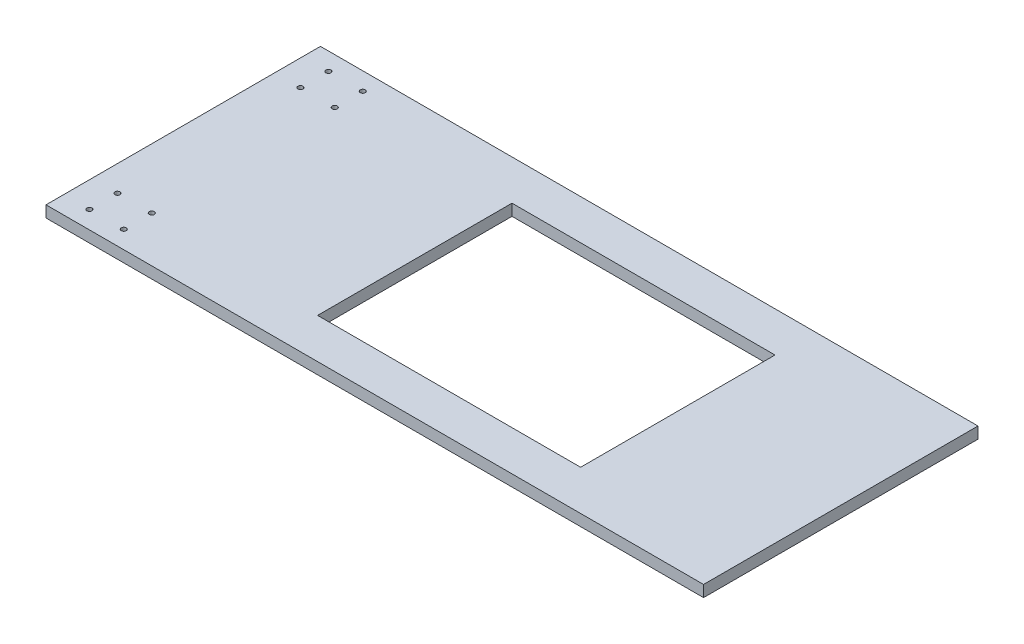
ISO-10303-21;
HEADER;
FILE_DESCRIPTION(('STEP AP214'),'2;1');
FILE_NAME('part.step','',(''),(''),'','','');
FILE_SCHEMA(('AUTOMOTIVE_DESIGN { 1 0 10303 214 1 1 1 1 }'));
ENDSEC;
DATA;
#1=APPLICATION_CONTEXT('core data for automotive mechanical design processes');
#2=APPLICATION_PROTOCOL_DEFINITION('international standard','automotive_design',2000,#1);
#3=PRODUCT_CONTEXT('',#1,'mechanical');
#4=PRODUCT('Part','Part','',(#3));
#5=PRODUCT_RELATED_PRODUCT_CATEGORY('part','',(#4));
#6=PRODUCT_DEFINITION_FORMATION('','',#4);
#7=PRODUCT_DEFINITION_CONTEXT('part definition',#1,'design');
#8=PRODUCT_DEFINITION('design','',#6,#7);
#9=PRODUCT_DEFINITION_SHAPE('','',#8);
#10=(LENGTH_UNIT() NAMED_UNIT(*) SI_UNIT(.MILLI.,.METRE.));
#11=(NAMED_UNIT(*) PLANE_ANGLE_UNIT() SI_UNIT($,.RADIAN.));
#12=(NAMED_UNIT(*) SI_UNIT($,.STERADIAN.) SOLID_ANGLE_UNIT());
#13=UNCERTAINTY_MEASURE_WITH_UNIT(LENGTH_MEASURE(1.E-05),#10,'distance_accuracy_value','');
#14=(GEOMETRIC_REPRESENTATION_CONTEXT(3) GLOBAL_UNCERTAINTY_ASSIGNED_CONTEXT((#13)) GLOBAL_UNIT_ASSIGNED_CONTEXT((#10,
#11,#12)) REPRESENTATION_CONTEXT('',''));
#15=CARTESIAN_POINT('',(0.,0.,0.));
#16=DIRECTION('',(0.,0.,1.));
#17=DIRECTION('',(1.,0.,0.));
#18=AXIS2_PLACEMENT_3D('',#15,#16,#17);
#19=CARTESIAN_POINT('',(-287.5,31.5,-120.));
#20=DIRECTION('',(1.,0.,0.));
#21=DIRECTION('',(0.,0.,-1.));
#22=AXIS2_PLACEMENT_3D('',#19,#20,#21);
#23=PLANE('',#22);
#24=DIRECTION('',(0.,0.,1.));
#25=VECTOR('',#24,1.);
#26=CARTESIAN_POINT('',(-287.5,0.,-120.));
#27=LINE('',#26,#25);
#28=CARTESIAN_POINT('',(-287.5,0.,-120.));
#29=VERTEX_POINT('',#28);
#30=CARTESIAN_POINT('',(-287.5,0.,120.));
#31=VERTEX_POINT('',#30);
#32=EDGE_CURVE('E139',#29,#31,#27,.T.);
#33=ORIENTED_EDGE('',*,*,#32,.T.);
#34=DIRECTION('',(0.,-1.,0.));
#35=VECTOR('',#34,1.);
#36=CARTESIAN_POINT('',(-287.5,31.5,120.));
#37=LINE('',#36,#35);
#38=CARTESIAN_POINT('',(-287.5,10.,120.));
#39=VERTEX_POINT('',#38);
#40=EDGE_CURVE('E12',#39,#31,#37,.T.);
#41=ORIENTED_EDGE('',*,*,#40,.F.);
#42=DIRECTION('',(0.,0.,-1.));
#43=VECTOR('',#42,1.);
#44=CARTESIAN_POINT('',(-287.5,10.,-120.));
#45=LINE('',#44,#43);
#46=CARTESIAN_POINT('',(-287.5,10.,-120.));
#47=VERTEX_POINT('',#46);
#48=EDGE_CURVE('E101',#39,#47,#45,.T.);
#49=ORIENTED_EDGE('',*,*,#48,.T.);
#50=DIRECTION('',(0.,-1.,0.));
#51=VECTOR('',#50,1.);
#52=CARTESIAN_POINT('',(-287.5,31.5,-120.));
#53=LINE('',#52,#51);
#54=EDGE_CURVE('E104',#47,#29,#53,.T.);
#55=ORIENTED_EDGE('',*,*,#54,.T.);
#56=EDGE_LOOP('',(#33,#41,#49,#55));
#57=FACE_BOUND('',#56,.T.);
#58=ADVANCED_FACE('F37',(#57),#23,.F.);
#59=CARTESIAN_POINT('',(287.5,31.5,120.));
#60=DIRECTION('',(0.,0.,-1.));
#61=DIRECTION('',(-1.,0.,0.));
#62=AXIS2_PLACEMENT_3D('',#59,#60,#61);
#63=PLANE('',#62);
#64=DIRECTION('',(0.,-1.,0.));
#65=VECTOR('',#64,1.);
#66=CARTESIAN_POINT('',(287.5,31.5,120.));
#67=LINE('',#66,#65);
#68=CARTESIAN_POINT('',(287.5,10.,120.));
#69=VERTEX_POINT('',#68);
#70=CARTESIAN_POINT('',(287.5,0.,120.));
#71=VERTEX_POINT('',#70);
#72=EDGE_CURVE('E44',#69,#71,#67,.T.);
#73=ORIENTED_EDGE('',*,*,#72,.F.);
#74=DIRECTION('',(-1.,0.,0.));
#75=VECTOR('',#74,1.);
#76=CARTESIAN_POINT('',(287.5,10.,120.));
#77=LINE('',#76,#75);
#78=EDGE_CURVE('E199',#69,#39,#77,.T.);
#79=ORIENTED_EDGE('',*,*,#78,.T.);
#80=ORIENTED_EDGE('',*,*,#40,.T.);
#81=DIRECTION('',(1.,0.,0.));
#82=VECTOR('',#81,1.);
#83=CARTESIAN_POINT('',(287.5,0.,120.));
#84=LINE('',#83,#82);
#85=EDGE_CURVE('E136',#31,#71,#84,.T.);
#86=ORIENTED_EDGE('',*,*,#85,.T.);
#87=EDGE_LOOP('',(#73,#79,#80,#86));
#88=FACE_BOUND('',#87,.T.);
#89=ADVANCED_FACE('F137',(#88),#63,.F.);
#90=CARTESIAN_POINT('',(287.5,31.5,-120.));
#91=DIRECTION('',(-1.,0.,0.));
#92=DIRECTION('',(0.,0.,1.));
#93=AXIS2_PLACEMENT_3D('',#90,#91,#92);
#94=PLANE('',#93);
#95=DIRECTION('',(0.,-1.,0.));
#96=VECTOR('',#95,1.);
#97=CARTESIAN_POINT('',(287.5,31.5,-120.));
#98=LINE('',#97,#96);
#99=CARTESIAN_POINT('',(287.5,10.,-120.));
#100=VERTEX_POINT('',#99);
#101=CARTESIAN_POINT('',(287.5,0.,-120.));
#102=VERTEX_POINT('',#101);
#103=EDGE_CURVE('E122',#100,#102,#98,.T.);
#104=ORIENTED_EDGE('',*,*,#103,.F.);
#105=DIRECTION('',(0.,0.,1.));
#106=VECTOR('',#105,1.);
#107=CARTESIAN_POINT('',(287.5,10.,-120.));
#108=LINE('',#107,#106);
#109=EDGE_CURVE('E114',#100,#69,#108,.T.);
#110=ORIENTED_EDGE('',*,*,#109,.T.);
#111=ORIENTED_EDGE('',*,*,#72,.T.);
#112=DIRECTION('',(0.,0.,-1.));
#113=VECTOR('',#112,1.);
#114=CARTESIAN_POINT('',(287.5,0.,-120.));
#115=LINE('',#114,#113);
#116=EDGE_CURVE('E125',#71,#102,#115,.T.);
#117=ORIENTED_EDGE('',*,*,#116,.T.);
#118=EDGE_LOOP('',(#104,#110,#111,#117));
#119=FACE_BOUND('',#118,.T.);
#120=ADVANCED_FACE('F132',(#119),#94,.F.);
#121=CARTESIAN_POINT('',(287.5,31.5,-120.));
#122=DIRECTION('',(0.,0.,1.));
#123=DIRECTION('',(1.,0.,0.));
#124=AXIS2_PLACEMENT_3D('',#121,#122,#123);
#125=PLANE('',#124);
#126=ORIENTED_EDGE('',*,*,#54,.F.);
#127=DIRECTION('',(1.,0.,0.));
#128=VECTOR('',#127,1.);
#129=CARTESIAN_POINT('',(287.5,10.,-120.));
#130=LINE('',#129,#128);
#131=EDGE_CURVE('E108',#47,#100,#130,.T.);
#132=ORIENTED_EDGE('',*,*,#131,.T.);
#133=ORIENTED_EDGE('',*,*,#103,.T.);
#134=DIRECTION('',(-1.,0.,0.));
#135=VECTOR('',#134,1.);
#136=CARTESIAN_POINT('',(287.5,0.,-120.));
#137=LINE('',#136,#135);
#138=EDGE_CURVE('E120',#102,#29,#137,.T.);
#139=ORIENTED_EDGE('',*,*,#138,.T.);
#140=EDGE_LOOP('',(#126,#132,#133,#139));
#141=FACE_BOUND('',#140,.T.);
#142=ADVANCED_FACE('F118',(#141),#125,.F.);
#143=CARTESIAN_POINT('',(0.,0.,0.));
#144=DIRECTION('',(0.,-1.,0.));
#145=DIRECTION('',(0.,0.,-1.));
#146=AXIS2_PLACEMENT_3D('',#143,#144,#145);
#147=PLANE('',#146);
#148=ORIENTED_EDGE('',*,*,#85,.F.);
#149=ORIENTED_EDGE('',*,*,#32,.F.);
#150=ORIENTED_EDGE('',*,*,#138,.F.);
#151=ORIENTED_EDGE('',*,*,#116,.F.);
#152=EDGE_LOOP('',(#148,#149,#150,#151));
#153=FACE_BOUND('',#152,.T.);
#154=CARTESIAN_POINT('',(-235.,0.,-80.));
#155=DIRECTION('',(0.,-1.,0.));
#156=DIRECTION('',(0.,0.,-1.));
#157=AXIS2_PLACEMENT_3D('',#154,#155,#156);
#158=CIRCLE('',#157,2.19999999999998);
#159=CARTESIAN_POINT('',(-235.,0.,-82.2));
#160=VERTEX_POINT('',#159);
#161=EDGE_CURVE('E178',#160,#160,#158,.F.);
#162=ORIENTED_EDGE('',*,*,#161,.T.);
#163=EDGE_LOOP('',(#162));
#164=FACE_BOUND('',#163,.T.);
#165=CARTESIAN_POINT('',(-235.,0.,-104.5));
#166=DIRECTION('',(0.,-1.,0.));
#167=DIRECTION('',(0.,0.,-1.));
#168=AXIS2_PLACEMENT_3D('',#165,#166,#167);
#169=CIRCLE('',#168,2.19999999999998);
#170=CARTESIAN_POINT('',(-235.,0.,-106.7));
#171=VERTEX_POINT('',#170);
#172=EDGE_CURVE('E181',#171,#171,#169,.F.);
#173=ORIENTED_EDGE('',*,*,#172,.T.);
#174=EDGE_LOOP('',(#173));
#175=FACE_BOUND('',#174,.T.);
#176=CARTESIAN_POINT('',(-265.,0.,-104.5));
#177=DIRECTION('',(0.,-1.,0.));
#178=DIRECTION('',(0.,0.,-1.));
#179=AXIS2_PLACEMENT_3D('',#176,#177,#178);
#180=CIRCLE('',#179,2.19999999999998);
#181=CARTESIAN_POINT('',(-265.,0.,-106.7));
#182=VERTEX_POINT('',#181);
#183=EDGE_CURVE('E184',#182,#182,#180,.F.);
#184=ORIENTED_EDGE('',*,*,#183,.T.);
#185=EDGE_LOOP('',(#184));
#186=FACE_BOUND('',#185,.T.);
#187=CARTESIAN_POINT('',(-265.,0.,-80.));
#188=DIRECTION('',(0.,-1.,0.));
#189=DIRECTION('',(0.,0.,-1.));
#190=AXIS2_PLACEMENT_3D('',#187,#188,#189);
#191=CIRCLE('',#190,2.19999999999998);
#192=CARTESIAN_POINT('',(-265.,0.,-82.2));
#193=VERTEX_POINT('',#192);
#194=EDGE_CURVE('E187',#193,#193,#191,.F.);
#195=ORIENTED_EDGE('',*,*,#194,.T.);
#196=EDGE_LOOP('',(#195));
#197=FACE_BOUND('',#196,.T.);
#198=CARTESIAN_POINT('',(-235.,0.,80.));
#199=DIRECTION('',(0.,-1.,0.));
#200=DIRECTION('',(0.,0.,-1.));
#201=AXIS2_PLACEMENT_3D('',#198,#199,#200);
#202=CIRCLE('',#201,2.19999999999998);
#203=CARTESIAN_POINT('',(-235.,0.,77.8));
#204=VERTEX_POINT('',#203);
#205=EDGE_CURVE('E166',#204,#204,#202,.T.);
#206=ORIENTED_EDGE('',*,*,#205,.F.);
#207=EDGE_LOOP('',(#206));
#208=FACE_BOUND('',#207,.T.);
#209=CARTESIAN_POINT('',(-235.,0.,104.5));
#210=DIRECTION('',(0.,-1.,0.));
#211=DIRECTION('',(0.,0.,-1.));
#212=AXIS2_PLACEMENT_3D('',#209,#210,#211);
#213=CIRCLE('',#212,2.19999999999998);
#214=CARTESIAN_POINT('',(-235.,0.,102.3));
#215=VERTEX_POINT('',#214);
#216=EDGE_CURVE('E169',#215,#215,#213,.T.);
#217=ORIENTED_EDGE('',*,*,#216,.F.);
#218=EDGE_LOOP('',(#217));
#219=FACE_BOUND('',#218,.T.);
#220=CARTESIAN_POINT('',(-265.,0.,104.5));
#221=DIRECTION('',(0.,-1.,0.));
#222=DIRECTION('',(0.,0.,-1.));
#223=AXIS2_PLACEMENT_3D('',#220,#221,#222);
#224=CIRCLE('',#223,2.19999999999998);
#225=CARTESIAN_POINT('',(-265.,0.,102.3));
#226=VERTEX_POINT('',#225);
#227=EDGE_CURVE('E172',#226,#226,#224,.T.);
#228=ORIENTED_EDGE('',*,*,#227,.F.);
#229=EDGE_LOOP('',(#228));
#230=FACE_BOUND('',#229,.T.);
#231=CARTESIAN_POINT('',(-265.,0.,80.));
#232=DIRECTION('',(0.,-1.,0.));
#233=DIRECTION('',(0.,0.,-1.));
#234=AXIS2_PLACEMENT_3D('',#231,#232,#233);
#235=CIRCLE('',#234,2.19999999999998);
#236=CARTESIAN_POINT('',(-265.,0.,77.8));
#237=VERTEX_POINT('',#236);
#238=EDGE_CURVE('E175',#237,#237,#235,.T.);
#239=ORIENTED_EDGE('',*,*,#238,.F.);
#240=EDGE_LOOP('',(#239));
#241=FACE_BOUND('',#240,.T.);
#242=DIRECTION('',(0.,0.,1.));
#243=VECTOR('',#242,1.);
#244=CARTESIAN_POINT('',(-85.,0.,-85.));
#245=LINE('',#244,#243);
#246=CARTESIAN_POINT('',(-85.,0.,-85.));
#247=VERTEX_POINT('',#246);
#248=CARTESIAN_POINT('',(-85.,0.,85.));
#249=VERTEX_POINT('',#248);
#250=EDGE_CURVE('E163',#247,#249,#245,.T.);
#251=ORIENTED_EDGE('',*,*,#250,.T.);
#252=DIRECTION('',(1.,0.,0.));
#253=VECTOR('',#252,1.);
#254=CARTESIAN_POINT('',(145.,0.,85.));
#255=LINE('',#254,#253);
#256=CARTESIAN_POINT('',(145.,0.,85.));
#257=VERTEX_POINT('',#256);
#258=EDGE_CURVE('E160',#249,#257,#255,.T.);
#259=ORIENTED_EDGE('',*,*,#258,.T.);
#260=DIRECTION('',(0.,0.,-1.));
#261=VECTOR('',#260,1.);
#262=CARTESIAN_POINT('',(145.,0.,-85.));
#263=LINE('',#262,#261);
#264=CARTESIAN_POINT('',(145.,0.,-85.));
#265=VERTEX_POINT('',#264);
#266=EDGE_CURVE('E59',#257,#265,#263,.T.);
#267=ORIENTED_EDGE('',*,*,#266,.T.);
#268=DIRECTION('',(-1.,0.,0.));
#269=VECTOR('',#268,1.);
#270=CARTESIAN_POINT('',(145.,0.,-85.));
#271=LINE('',#270,#269);
#272=EDGE_CURVE('E150',#265,#247,#271,.T.);
#273=ORIENTED_EDGE('',*,*,#272,.T.);
#274=EDGE_LOOP('',(#251,#259,#267,#273));
#275=FACE_BOUND('',#274,.T.);
#276=ADVANCED_FACE('F141',(#153,#164,#175,#186,#197,#208,#219,#230,#241,#275),#147,.T.);
#277=CARTESIAN_POINT('',(-85.,0.,-85.));
#278=DIRECTION('',(-1.,0.,0.));
#279=DIRECTION('',(0.,0.,1.));
#280=AXIS2_PLACEMENT_3D('',#277,#278,#279);
#281=PLANE('',#280);
#282=DIRECTION('',(0.,1.,0.));
#283=VECTOR('',#282,1.);
#284=CARTESIAN_POINT('',(-85.,0.,-85.));
#285=LINE('',#284,#283);
#286=CARTESIAN_POINT('',(-85.,10.,-85.));
#287=VERTEX_POINT('',#286);
#288=EDGE_CURVE('E145',#247,#287,#285,.T.);
#289=ORIENTED_EDGE('',*,*,#288,.T.);
#290=DIRECTION('',(0.,0.,1.));
#291=VECTOR('',#290,1.);
#292=CARTESIAN_POINT('',(-85.,10.,-85.));
#293=LINE('',#292,#291);
#294=CARTESIAN_POINT('',(-85.,10.,85.));
#295=VERTEX_POINT('',#294);
#296=EDGE_CURVE('E190',#287,#295,#293,.T.);
#297=ORIENTED_EDGE('',*,*,#296,.T.);
#298=DIRECTION('',(0.,1.,0.));
#299=VECTOR('',#298,1.);
#300=CARTESIAN_POINT('',(-85.,0.,85.));
#301=LINE('',#300,#299);
#302=EDGE_CURVE('E146',#249,#295,#301,.T.);
#303=ORIENTED_EDGE('',*,*,#302,.F.);
#304=ORIENTED_EDGE('',*,*,#250,.F.);
#305=EDGE_LOOP('',(#289,#297,#303,#304));
#306=FACE_BOUND('',#305,.T.);
#307=ADVANCED_FACE('F256',(#306),#281,.F.);
#308=CARTESIAN_POINT('',(145.,0.,-85.));
#309=DIRECTION('',(0.,0.,-1.));
#310=DIRECTION('',(-1.,0.,0.));
#311=AXIS2_PLACEMENT_3D('',#308,#309,#310);
#312=PLANE('',#311);
#313=DIRECTION('',(0.,1.,0.));
#314=VECTOR('',#313,1.);
#315=CARTESIAN_POINT('',(145.,0.,-85.));
#316=LINE('',#315,#314);
#317=CARTESIAN_POINT('',(145.,10.,-85.));
#318=VERTEX_POINT('',#317);
#319=EDGE_CURVE('E152',#265,#318,#316,.T.);
#320=ORIENTED_EDGE('',*,*,#319,.T.);
#321=DIRECTION('',(-1.,0.,0.));
#322=VECTOR('',#321,1.);
#323=CARTESIAN_POINT('',(145.,10.,-85.));
#324=LINE('',#323,#322);
#325=EDGE_CURVE('E193',#318,#287,#324,.T.);
#326=ORIENTED_EDGE('',*,*,#325,.T.);
#327=ORIENTED_EDGE('',*,*,#288,.F.);
#328=ORIENTED_EDGE('',*,*,#272,.F.);
#329=EDGE_LOOP('',(#320,#326,#327,#328));
#330=FACE_BOUND('',#329,.T.);
#331=ADVANCED_FACE('F259',(#330),#312,.F.);
#332=CARTESIAN_POINT('',(145.,0.,-85.));
#333=DIRECTION('',(1.,0.,0.));
#334=DIRECTION('',(0.,0.,-1.));
#335=AXIS2_PLACEMENT_3D('',#332,#333,#334);
#336=PLANE('',#335);
#337=DIRECTION('',(0.,1.,0.));
#338=VECTOR('',#337,1.);
#339=CARTESIAN_POINT('',(145.,0.,85.));
#340=LINE('',#339,#338);
#341=CARTESIAN_POINT('',(145.,10.,85.));
#342=VERTEX_POINT('',#341);
#343=EDGE_CURVE('E149',#257,#342,#340,.T.);
#344=ORIENTED_EDGE('',*,*,#343,.T.);
#345=DIRECTION('',(0.,0.,-1.));
#346=VECTOR('',#345,1.);
#347=CARTESIAN_POINT('',(145.,10.,-85.));
#348=LINE('',#347,#346);
#349=EDGE_CURVE('E51',#342,#318,#348,.T.);
#350=ORIENTED_EDGE('',*,*,#349,.T.);
#351=ORIENTED_EDGE('',*,*,#319,.F.);
#352=ORIENTED_EDGE('',*,*,#266,.F.);
#353=EDGE_LOOP('',(#344,#350,#351,#352));
#354=FACE_BOUND('',#353,.T.);
#355=ADVANCED_FACE('F264',(#354),#336,.F.);
#356=CARTESIAN_POINT('',(145.,0.,85.));
#357=DIRECTION('',(0.,0.,1.));
#358=DIRECTION('',(1.,0.,0.));
#359=AXIS2_PLACEMENT_3D('',#356,#357,#358);
#360=PLANE('',#359);
#361=ORIENTED_EDGE('',*,*,#302,.T.);
#362=DIRECTION('',(1.,0.,0.));
#363=VECTOR('',#362,1.);
#364=CARTESIAN_POINT('',(145.,10.,85.));
#365=LINE('',#364,#363);
#366=EDGE_CURVE('E197',#295,#342,#365,.T.);
#367=ORIENTED_EDGE('',*,*,#366,.T.);
#368=ORIENTED_EDGE('',*,*,#343,.F.);
#369=ORIENTED_EDGE('',*,*,#258,.F.);
#370=EDGE_LOOP('',(#361,#367,#368,#369));
#371=FACE_BOUND('',#370,.T.);
#372=ADVANCED_FACE('F261',(#371),#360,.F.);
#373=CARTESIAN_POINT('',(-265.,-3.,80.));
#374=DIRECTION('',(0.,1.,0.));
#375=DIRECTION('',(0.,0.,1.));
#376=AXIS2_PLACEMENT_3D('',#373,#374,#375);
#377=CYLINDRICAL_SURFACE('',#376,2.19999999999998);
#378=ORIENTED_EDGE('',*,*,#238,.T.);
#379=EDGE_LOOP('',(#378));
#380=FACE_BOUND('',#379,.T.);
#381=CARTESIAN_POINT('',(-265.,10.,80.));
#382=DIRECTION('',(0.,-1.,0.));
#383=DIRECTION('',(0.,0.,-1.));
#384=AXIS2_PLACEMENT_3D('',#381,#382,#383);
#385=CIRCLE('',#384,2.19999999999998);
#386=CARTESIAN_POINT('',(-265.,10.,77.8));
#387=VERTEX_POINT('',#386);
#388=EDGE_CURVE('E217',#387,#387,#385,.T.);
#389=ORIENTED_EDGE('',*,*,#388,.F.);
#390=EDGE_LOOP('',(#389));
#391=FACE_BOUND('',#390,.T.);
#392=ADVANCED_FACE('F240',(#380,#391),#377,.F.);
#393=CARTESIAN_POINT('',(-265.,-3.,104.5));
#394=DIRECTION('',(0.,1.,0.));
#395=DIRECTION('',(0.,0.,1.));
#396=AXIS2_PLACEMENT_3D('',#393,#394,#395);
#397=CYLINDRICAL_SURFACE('',#396,2.19999999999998);
#398=ORIENTED_EDGE('',*,*,#227,.T.);
#399=EDGE_LOOP('',(#398));
#400=FACE_BOUND('',#399,.T.);
#401=CARTESIAN_POINT('',(-265.,10.,104.5));
#402=DIRECTION('',(0.,-1.,0.));
#403=DIRECTION('',(0.,0.,-1.));
#404=AXIS2_PLACEMENT_3D('',#401,#402,#403);
#405=CIRCLE('',#404,2.19999999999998);
#406=CARTESIAN_POINT('',(-265.,10.,102.3));
#407=VERTEX_POINT('',#406);
#408=EDGE_CURVE('E220',#407,#407,#405,.T.);
#409=ORIENTED_EDGE('',*,*,#408,.F.);
#410=EDGE_LOOP('',(#409));
#411=FACE_BOUND('',#410,.T.);
#412=ADVANCED_FACE('F230',(#400,#411),#397,.F.);
#413=CARTESIAN_POINT('',(-235.,-3.,104.5));
#414=DIRECTION('',(0.,1.,0.));
#415=DIRECTION('',(0.,0.,1.));
#416=AXIS2_PLACEMENT_3D('',#413,#414,#415);
#417=CYLINDRICAL_SURFACE('',#416,2.19999999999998);
#418=ORIENTED_EDGE('',*,*,#216,.T.);
#419=EDGE_LOOP('',(#418));
#420=FACE_BOUND('',#419,.T.);
#421=CARTESIAN_POINT('',(-235.,10.,104.5));
#422=DIRECTION('',(0.,-1.,0.));
#423=DIRECTION('',(0.,0.,-1.));
#424=AXIS2_PLACEMENT_3D('',#421,#422,#423);
#425=CIRCLE('',#424,2.19999999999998);
#426=CARTESIAN_POINT('',(-235.,10.,102.3));
#427=VERTEX_POINT('',#426);
#428=EDGE_CURVE('E109',#427,#427,#425,.T.);
#429=ORIENTED_EDGE('',*,*,#428,.F.);
#430=EDGE_LOOP('',(#429));
#431=FACE_BOUND('',#430,.T.);
#432=ADVANCED_FACE('F227',(#420,#431),#417,.F.);
#433=CARTESIAN_POINT('',(-235.,-3.,80.));
#434=DIRECTION('',(0.,1.,0.));
#435=DIRECTION('',(0.,0.,1.));
#436=AXIS2_PLACEMENT_3D('',#433,#434,#435);
#437=CYLINDRICAL_SURFACE('',#436,2.19999999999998);
#438=ORIENTED_EDGE('',*,*,#205,.T.);
#439=EDGE_LOOP('',(#438));
#440=FACE_BOUND('',#439,.T.);
#441=CARTESIAN_POINT('',(-235.,10.,80.));
#442=DIRECTION('',(0.,-1.,0.));
#443=DIRECTION('',(0.,0.,-1.));
#444=AXIS2_PLACEMENT_3D('',#441,#442,#443);
#445=CIRCLE('',#444,2.19999999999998);
#446=CARTESIAN_POINT('',(-235.,10.,77.8));
#447=VERTEX_POINT('',#446);
#448=EDGE_CURVE('E214',#447,#447,#445,.T.);
#449=ORIENTED_EDGE('',*,*,#448,.F.);
#450=EDGE_LOOP('',(#449));
#451=FACE_BOUND('',#450,.T.);
#452=ADVANCED_FACE('F229',(#440,#451),#437,.F.);
#453=CARTESIAN_POINT('',(-265.,-3.,-80.));
#454=DIRECTION('',(0.,1.,0.));
#455=DIRECTION('',(0.,0.,1.));
#456=AXIS2_PLACEMENT_3D('',#453,#454,#455);
#457=CYLINDRICAL_SURFACE('',#456,2.19999999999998);
#458=ORIENTED_EDGE('',*,*,#194,.F.);
#459=EDGE_LOOP('',(#458));
#460=FACE_BOUND('',#459,.T.);
#461=CARTESIAN_POINT('',(-265.,10.,-80.));
#462=DIRECTION('',(0.,-1.,0.));
#463=DIRECTION('',(0.,0.,-1.));
#464=AXIS2_PLACEMENT_3D('',#461,#462,#463);
#465=CIRCLE('',#464,2.19999999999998);
#466=CARTESIAN_POINT('',(-265.,10.,-82.2));
#467=VERTEX_POINT('',#466);
#468=EDGE_CURVE('E211',#467,#467,#465,.T.);
#469=ORIENTED_EDGE('',*,*,#468,.F.);
#470=EDGE_LOOP('',(#469));
#471=FACE_BOUND('',#470,.T.);
#472=ADVANCED_FACE('F237',(#460,#471),#457,.F.);
#473=CARTESIAN_POINT('',(-265.,-3.,-104.5));
#474=DIRECTION('',(0.,1.,0.));
#475=DIRECTION('',(0.,0.,1.));
#476=AXIS2_PLACEMENT_3D('',#473,#474,#475);
#477=CYLINDRICAL_SURFACE('',#476,2.19999999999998);
#478=ORIENTED_EDGE('',*,*,#183,.F.);
#479=EDGE_LOOP('',(#478));
#480=FACE_BOUND('',#479,.T.);
#481=CARTESIAN_POINT('',(-265.,10.,-104.5));
#482=DIRECTION('',(0.,-1.,0.));
#483=DIRECTION('',(0.,0.,-1.));
#484=AXIS2_PLACEMENT_3D('',#481,#482,#483);
#485=CIRCLE('',#484,2.19999999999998);
#486=CARTESIAN_POINT('',(-265.,10.,-106.7));
#487=VERTEX_POINT('',#486);
#488=EDGE_CURVE('E208',#487,#487,#485,.T.);
#489=ORIENTED_EDGE('',*,*,#488,.F.);
#490=EDGE_LOOP('',(#489));
#491=FACE_BOUND('',#490,.T.);
#492=ADVANCED_FACE('F292',(#480,#491),#477,.F.);
#493=CARTESIAN_POINT('',(-235.,-3.,-104.5));
#494=DIRECTION('',(0.,1.,0.));
#495=DIRECTION('',(0.,0.,1.));
#496=AXIS2_PLACEMENT_3D('',#493,#494,#495);
#497=CYLINDRICAL_SURFACE('',#496,2.19999999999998);
#498=ORIENTED_EDGE('',*,*,#172,.F.);
#499=EDGE_LOOP('',(#498));
#500=FACE_BOUND('',#499,.T.);
#501=CARTESIAN_POINT('',(-235.,10.,-104.5));
#502=DIRECTION('',(0.,-1.,0.));
#503=DIRECTION('',(0.,0.,-1.));
#504=AXIS2_PLACEMENT_3D('',#501,#502,#503);
#505=CIRCLE('',#504,2.19999999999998);
#506=CARTESIAN_POINT('',(-235.,10.,-106.7));
#507=VERTEX_POINT('',#506);
#508=EDGE_CURVE('E205',#507,#507,#505,.T.);
#509=ORIENTED_EDGE('',*,*,#508,.F.);
#510=EDGE_LOOP('',(#509));
#511=FACE_BOUND('',#510,.T.);
#512=ADVANCED_FACE('F288',(#500,#511),#497,.F.);
#513=CARTESIAN_POINT('',(-235.,-3.,-80.));
#514=DIRECTION('',(0.,1.,0.));
#515=DIRECTION('',(0.,0.,1.));
#516=AXIS2_PLACEMENT_3D('',#513,#514,#515);
#517=CYLINDRICAL_SURFACE('',#516,2.19999999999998);
#518=ORIENTED_EDGE('',*,*,#161,.F.);
#519=EDGE_LOOP('',(#518));
#520=FACE_BOUND('',#519,.T.);
#521=CARTESIAN_POINT('',(-235.,10.,-80.));
#522=DIRECTION('',(0.,-1.,0.));
#523=DIRECTION('',(0.,0.,-1.));
#524=AXIS2_PLACEMENT_3D('',#521,#522,#523);
#525=CIRCLE('',#524,2.19999999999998);
#526=CARTESIAN_POINT('',(-235.,10.,-82.2));
#527=VERTEX_POINT('',#526);
#528=EDGE_CURVE('E202',#527,#527,#525,.T.);
#529=ORIENTED_EDGE('',*,*,#528,.F.);
#530=EDGE_LOOP('',(#529));
#531=FACE_BOUND('',#530,.T.);
#532=ADVANCED_FACE('F281',(#520,#531),#517,.F.);
#533=CARTESIAN_POINT('',(0.,10.,0.));
#534=DIRECTION('',(0.,-1.,0.));
#535=DIRECTION('',(0.,0.,-1.));
#536=AXIS2_PLACEMENT_3D('',#533,#534,#535);
#537=PLANE('',#536);
#538=ORIENTED_EDGE('',*,*,#131,.F.);
#539=ORIENTED_EDGE('',*,*,#48,.F.);
#540=ORIENTED_EDGE('',*,*,#78,.F.);
#541=ORIENTED_EDGE('',*,*,#109,.F.);
#542=EDGE_LOOP('',(#538,#539,#540,#541));
#543=FACE_BOUND('',#542,.T.);
#544=ORIENTED_EDGE('',*,*,#325,.F.);
#545=ORIENTED_EDGE('',*,*,#349,.F.);
#546=ORIENTED_EDGE('',*,*,#366,.F.);
#547=ORIENTED_EDGE('',*,*,#296,.F.);
#548=EDGE_LOOP('',(#544,#545,#546,#547));
#549=FACE_BOUND('',#548,.T.);
#550=ORIENTED_EDGE('',*,*,#528,.T.);
#551=EDGE_LOOP('',(#550));
#552=FACE_BOUND('',#551,.T.);
#553=ORIENTED_EDGE('',*,*,#508,.T.);
#554=EDGE_LOOP('',(#553));
#555=FACE_BOUND('',#554,.T.);
#556=ORIENTED_EDGE('',*,*,#488,.T.);
#557=EDGE_LOOP('',(#556));
#558=FACE_BOUND('',#557,.T.);
#559=ORIENTED_EDGE('',*,*,#468,.T.);
#560=EDGE_LOOP('',(#559));
#561=FACE_BOUND('',#560,.T.);
#562=ORIENTED_EDGE('',*,*,#448,.T.);
#563=EDGE_LOOP('',(#562));
#564=FACE_BOUND('',#563,.T.);
#565=ORIENTED_EDGE('',*,*,#388,.T.);
#566=EDGE_LOOP('',(#565));
#567=FACE_BOUND('',#566,.T.);
#568=ORIENTED_EDGE('',*,*,#408,.T.);
#569=EDGE_LOOP('',(#568));
#570=FACE_BOUND('',#569,.T.);
#571=ORIENTED_EDGE('',*,*,#428,.T.);
#572=EDGE_LOOP('',(#571));
#573=FACE_BOUND('',#572,.T.);
#574=ADVANCED_FACE('F112',(#543,#549,#552,#555,#558,#561,#564,#567,#570,#573),#537,.F.);
#575=CLOSED_SHELL('',(#58,#89,#120,#142,#276,#307,#331,#355,#372,#392,#412,#432,#452,#472,#492,
#512,#532,#574));
#576=MANIFOLD_SOLID_BREP('B2',#575);
#577=ADVANCED_BREP_SHAPE_REPRESENTATION('',(#18,#576),#14);
#578=SHAPE_DEFINITION_REPRESENTATION(#9,#577);
ENDSEC;
END-ISO-10303-21;
